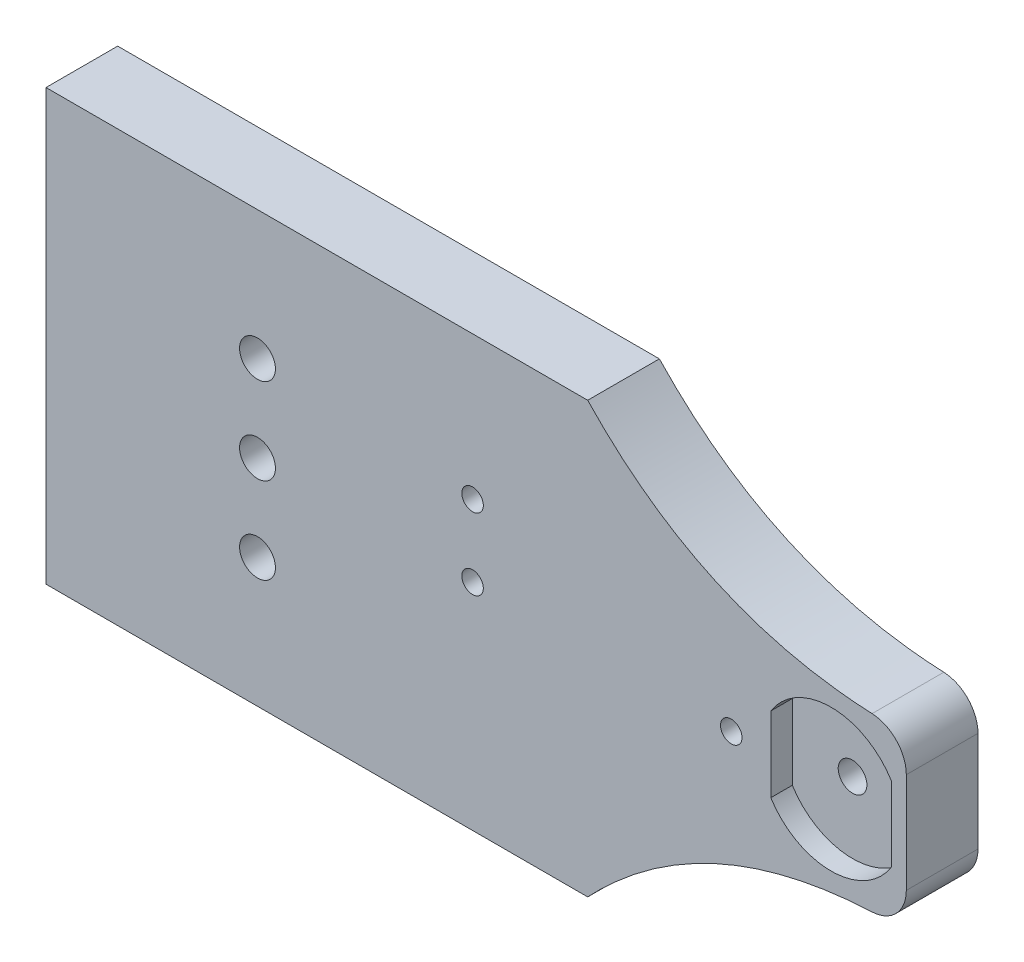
ISO-10303-21;
HEADER;
FILE_DESCRIPTION(('STEP AP214'),'2;1');
FILE_NAME('part.step','',(''),(''),'','','');
FILE_SCHEMA(('AUTOMOTIVE_DESIGN { 1 0 10303 214 1 1 1 1 }'));
ENDSEC;
DATA;
#1=APPLICATION_CONTEXT('core data for automotive mechanical design processes');
#2=APPLICATION_PROTOCOL_DEFINITION('international standard','automotive_design',2000,#1);
#3=PRODUCT_CONTEXT('',#1,'mechanical');
#4=PRODUCT('Part','Part','',(#3));
#5=PRODUCT_RELATED_PRODUCT_CATEGORY('part','',(#4));
#6=PRODUCT_DEFINITION_FORMATION('','',#4);
#7=PRODUCT_DEFINITION_CONTEXT('part definition',#1,'design');
#8=PRODUCT_DEFINITION('design','',#6,#7);
#9=PRODUCT_DEFINITION_SHAPE('','',#8);
#10=(LENGTH_UNIT() NAMED_UNIT(*) SI_UNIT(.MILLI.,.METRE.));
#11=(NAMED_UNIT(*) PLANE_ANGLE_UNIT() SI_UNIT($,.RADIAN.));
#12=(NAMED_UNIT(*) SI_UNIT($,.STERADIAN.) SOLID_ANGLE_UNIT());
#13=UNCERTAINTY_MEASURE_WITH_UNIT(LENGTH_MEASURE(1.E-05),#10,'distance_accuracy_value','');
#14=(GEOMETRIC_REPRESENTATION_CONTEXT(3) GLOBAL_UNCERTAINTY_ASSIGNED_CONTEXT((#13)) GLOBAL_UNIT_ASSIGNED_CONTEXT((#10,
#11,#12)) REPRESENTATION_CONTEXT('',''));
#15=CARTESIAN_POINT('',(0.,0.,0.));
#16=DIRECTION('',(0.,0.,1.));
#17=DIRECTION('',(1.,0.,0.));
#18=AXIS2_PLACEMENT_3D('',#15,#16,#17);
#19=CARTESIAN_POINT('',(13.9184000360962,1.95325542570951,7.));
#20=DIRECTION('',(0.,0.,1.));
#21=DIRECTION('',(1.,0.,0.));
#22=AXIS2_PLACEMENT_3D('',#19,#20,#21);
#23=CYLINDRICAL_SURFACE('',#22,9.9);
#24=CARTESIAN_POINT('',(13.9184000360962,1.95325542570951,10.));
#25=DIRECTION('',(0.,0.,1.));
#26=DIRECTION('',(1.,0.,0.));
#27=AXIS2_PLACEMENT_3D('',#24,#25,#26);
#28=CIRCLE('',#27,9.9);
#29=CARTESIAN_POINT('',(5.5184000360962,-3.28601933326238,10.));
#30=VERTEX_POINT('',#29);
#31=CARTESIAN_POINT('',(22.3184000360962,-3.28601933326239,10.));
#32=VERTEX_POINT('',#31);
#33=EDGE_CURVE('E316',#30,#32,#28,.T.);
#34=ORIENTED_EDGE('',*,*,#33,.T.);
#35=DIRECTION('',(0.,0.,1.));
#36=VECTOR('',#35,1.);
#37=CARTESIAN_POINT('',(22.3184000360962,-3.28601933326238,7.));
#38=LINE('',#37,#36);
#39=CARTESIAN_POINT('',(22.3184000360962,-3.28601933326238,7.));
#40=VERTEX_POINT('',#39);
#41=EDGE_CURVE('E319',#32,#40,#38,.F.);
#42=ORIENTED_EDGE('',*,*,#41,.T.);
#43=CARTESIAN_POINT('',(13.9184000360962,1.95325542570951,7.));
#44=DIRECTION('',(0.,0.,1.));
#45=DIRECTION('',(1.,0.,0.));
#46=AXIS2_PLACEMENT_3D('',#43,#44,#45);
#47=CIRCLE('',#46,9.9);
#48=CARTESIAN_POINT('',(5.5184000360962,-3.28601933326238,7.));
#49=VERTEX_POINT('',#48);
#50=EDGE_CURVE('E358',#49,#40,#47,.T.);
#51=ORIENTED_EDGE('',*,*,#50,.F.);
#52=DIRECTION('',(0.,0.,1.));
#53=VECTOR('',#52,1.);
#54=CARTESIAN_POINT('',(5.5184000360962,-3.28601933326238,7.));
#55=LINE('',#54,#53);
#56=EDGE_CURVE('E321',#49,#30,#55,.T.);
#57=ORIENTED_EDGE('',*,*,#56,.T.);
#58=EDGE_LOOP('',(#34,#42,#51,#57));
#59=FACE_BOUND('',#58,.T.);
#60=ADVANCED_FACE('F39',(#59),#23,.F.);
#61=CARTESIAN_POINT('',(-95.5815999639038,31.9532554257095,10.));
#62=DIRECTION('',(1.,0.,0.));
#63=DIRECTION('',(0.,1.,0.));
#64=AXIS2_PLACEMENT_3D('',#61,#62,#63);
#65=PLANE('',#64);
#66=DIRECTION('',(0.,-1.,0.));
#67=VECTOR('',#66,1.);
#68=CARTESIAN_POINT('',(-95.5815999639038,31.9532554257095,0.));
#69=LINE('',#68,#67);
#70=CARTESIAN_POINT('',(-95.5815999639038,31.9532554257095,0.));
#71=VERTEX_POINT('',#70);
#72=CARTESIAN_POINT('',(-95.5815999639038,-28.0467445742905,0.));
#73=VERTEX_POINT('',#72);
#74=EDGE_CURVE('E148',#71,#73,#69,.T.);
#75=ORIENTED_EDGE('',*,*,#74,.T.);
#76=DIRECTION('',(0.,0.,-1.));
#77=VECTOR('',#76,1.);
#78=CARTESIAN_POINT('',(-95.5815999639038,-28.0467445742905,10.));
#79=LINE('',#78,#77);
#80=CARTESIAN_POINT('',(-95.5815999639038,-28.0467445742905,10.));
#81=VERTEX_POINT('',#80);
#82=EDGE_CURVE('E162',#81,#73,#79,.T.);
#83=ORIENTED_EDGE('',*,*,#82,.F.);
#84=DIRECTION('',(0.,-1.,0.));
#85=VECTOR('',#84,1.);
#86=CARTESIAN_POINT('',(-95.5815999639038,31.9532554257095,10.));
#87=LINE('',#86,#85);
#88=CARTESIAN_POINT('',(-95.5815999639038,31.9532554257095,10.));
#89=VERTEX_POINT('',#88);
#90=EDGE_CURVE('E149',#89,#81,#87,.T.);
#91=ORIENTED_EDGE('',*,*,#90,.F.);
#92=DIRECTION('',(0.,0.,-1.));
#93=VECTOR('',#92,1.);
#94=CARTESIAN_POINT('',(-95.5815999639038,31.9532554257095,10.));
#95=LINE('',#94,#93);
#96=EDGE_CURVE('E160',#89,#71,#95,.T.);
#97=ORIENTED_EDGE('',*,*,#96,.T.);
#98=EDGE_LOOP('',(#75,#83,#91,#97));
#99=FACE_BOUND('',#98,.T.);
#100=ADVANCED_FACE('F299',(#99),#65,.F.);
#101=CARTESIAN_POINT('',(-95.5815999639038,-28.0467445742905,10.));
#102=DIRECTION('',(0.,1.,0.));
#103=DIRECTION('',(0.,0.,1.));
#104=AXIS2_PLACEMENT_3D('',#101,#102,#103);
#105=PLANE('',#104);
#106=DIRECTION('',(1.,0.,0.));
#107=VECTOR('',#106,1.);
#108=CARTESIAN_POINT('',(-95.5815999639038,-28.0467445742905,0.));
#109=LINE('',#108,#107);
#110=CARTESIAN_POINT('',(-20.02308866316,-28.0467445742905,0.));
#111=VERTEX_POINT('',#110);
#112=EDGE_CURVE('E156',#73,#111,#109,.T.);
#113=ORIENTED_EDGE('',*,*,#112,.T.);
#114=DIRECTION('',(0.,0.,1.));
#115=VECTOR('',#114,1.);
#116=CARTESIAN_POINT('',(-20.02308866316,-28.0467445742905,0.));
#117=LINE('',#116,#115);
#118=CARTESIAN_POINT('',(-20.02308866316,-28.0467445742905,10.));
#119=VERTEX_POINT('',#118);
#120=EDGE_CURVE('E214',#111,#119,#117,.T.);
#121=ORIENTED_EDGE('',*,*,#120,.T.);
#122=DIRECTION('',(1.,0.,0.));
#123=VECTOR('',#122,1.);
#124=CARTESIAN_POINT('',(-95.5815999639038,-28.0467445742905,10.));
#125=LINE('',#124,#123);
#126=EDGE_CURVE('E153',#81,#119,#125,.T.);
#127=ORIENTED_EDGE('',*,*,#126,.F.);
#128=ORIENTED_EDGE('',*,*,#82,.T.);
#129=EDGE_LOOP('',(#113,#121,#127,#128));
#130=FACE_BOUND('',#129,.T.);
#131=ADVANCED_FACE('F296',(#130),#105,.F.);
#132=CARTESIAN_POINT('',(24.4184000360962,31.9532554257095,10.));
#133=DIRECTION('',(-1.,0.,0.));
#134=DIRECTION('',(0.,-1.,0.));
#135=AXIS2_PLACEMENT_3D('',#132,#133,#134);
#136=PLANE('',#135);
#137=DIRECTION('',(0.,1.,0.));
#138=VECTOR('',#137,1.);
#139=CARTESIAN_POINT('',(24.4184000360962,31.9532554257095,0.));
#140=LINE('',#139,#138);
#141=CARTESIAN_POINT('',(24.4184000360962,-5.0320896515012,0.));
#142=VERTEX_POINT('',#141);
#143=CARTESIAN_POINT('',(24.4184000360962,8.93860050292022,0.));
#144=VERTEX_POINT('',#143);
#145=EDGE_CURVE('E150',#142,#144,#140,.T.);
#146=ORIENTED_EDGE('',*,*,#145,.T.);
#147=DIRECTION('',(0.,0.,1.));
#148=VECTOR('',#147,1.);
#149=CARTESIAN_POINT('',(24.4184000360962,8.93860050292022,10.));
#150=LINE('',#149,#148);
#151=CARTESIAN_POINT('',(24.4184000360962,8.93860050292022,10.));
#152=VERTEX_POINT('',#151);
#153=EDGE_CURVE('E194',#144,#152,#150,.T.);
#154=ORIENTED_EDGE('',*,*,#153,.T.);
#155=DIRECTION('',(0.,1.,0.));
#156=VECTOR('',#155,1.);
#157=CARTESIAN_POINT('',(24.4184000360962,31.9532554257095,10.));
#158=LINE('',#157,#156);
#159=CARTESIAN_POINT('',(24.4184000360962,-5.0320896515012,10.));
#160=VERTEX_POINT('',#159);
#161=EDGE_CURVE('E213',#160,#152,#158,.T.);
#162=ORIENTED_EDGE('',*,*,#161,.F.);
#163=DIRECTION('',(0.,0.,1.));
#164=VECTOR('',#163,1.);
#165=CARTESIAN_POINT('',(24.4184000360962,-5.0320896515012,10.));
#166=LINE('',#165,#164);
#167=EDGE_CURVE('E192',#160,#142,#166,.F.);
#168=ORIENTED_EDGE('',*,*,#167,.T.);
#169=EDGE_LOOP('',(#146,#154,#162,#168));
#170=FACE_BOUND('',#169,.T.);
#171=ADVANCED_FACE('F205',(#170),#136,.F.);
#172=CARTESIAN_POINT('',(-95.5815999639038,31.9532554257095,10.));
#173=DIRECTION('',(0.,-1.,0.));
#174=DIRECTION('',(0.,0.,-1.));
#175=AXIS2_PLACEMENT_3D('',#172,#173,#174);
#176=PLANE('',#175);
#177=DIRECTION('',(-1.,0.,0.));
#178=VECTOR('',#177,1.);
#179=CARTESIAN_POINT('',(-95.5815999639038,31.9532554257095,10.));
#180=LINE('',#179,#178);
#181=CARTESIAN_POINT('',(-20.02308866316,31.9532554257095,10.));
#182=VERTEX_POINT('',#181);
#183=EDGE_CURVE('E142',#182,#89,#180,.T.);
#184=ORIENTED_EDGE('',*,*,#183,.F.);
#185=DIRECTION('',(0.,0.,1.));
#186=VECTOR('',#185,1.);
#187=CARTESIAN_POINT('',(-20.02308866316,31.9532554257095,0.));
#188=LINE('',#187,#186);
#189=CARTESIAN_POINT('',(-20.02308866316,31.9532554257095,0.));
#190=VERTEX_POINT('',#189);
#191=EDGE_CURVE('E130',#190,#182,#188,.T.);
#192=ORIENTED_EDGE('',*,*,#191,.F.);
#193=DIRECTION('',(-1.,0.,0.));
#194=VECTOR('',#193,1.);
#195=CARTESIAN_POINT('',(-95.5815999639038,31.9532554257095,0.));
#196=LINE('',#195,#194);
#197=EDGE_CURVE('E140',#190,#71,#196,.T.);
#198=ORIENTED_EDGE('',*,*,#197,.T.);
#199=ORIENTED_EDGE('',*,*,#96,.F.);
#200=EDGE_LOOP('',(#184,#192,#198,#199));
#201=FACE_BOUND('',#200,.T.);
#202=ADVANCED_FACE('F138',(#201),#176,.F.);
#203=CARTESIAN_POINT('',(0.,0.,10.));
#204=DIRECTION('',(0.,0.,1.));
#205=DIRECTION('',(1.,0.,0.));
#206=AXIS2_PLACEMENT_3D('',#203,#204,#205);
#207=PLANE('',#206);
#208=CARTESIAN_POINT('',(0.,1.95325542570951,10.));
#209=DIRECTION('',(0.,0.,1.));
#210=DIRECTION('',(1.,0.,0.));
#211=AXIS2_PLACEMENT_3D('',#208,#209,#210);
#212=CIRCLE('',#211,1.5);
#213=CARTESIAN_POINT('',(1.49999999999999,1.95325542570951,10.));
#214=VERTEX_POINT('',#213);
#215=EDGE_CURVE('E371',#214,#214,#212,.T.);
#216=ORIENTED_EDGE('',*,*,#215,.F.);
#217=EDGE_LOOP('',(#216));
#218=FACE_BOUND('',#217,.T.);
#219=ORIENTED_EDGE('',*,*,#161,.T.);
#220=CARTESIAN_POINT('',(19.4184000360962,8.93860050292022,10.));
#221=DIRECTION('',(0.,0.,1.));
#222=DIRECTION('',(1.,0.,0.));
#223=AXIS2_PLACEMENT_3D('',#220,#221,#222);
#224=CIRCLE('',#223,5.);
#225=CARTESIAN_POINT('',(19.6444140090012,13.9334896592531,10.));
#226=VERTEX_POINT('',#225);
#227=EDGE_CURVE('E199',#152,#226,#224,.T.);
#228=ORIENTED_EDGE('',*,*,#227,.T.);
#229=CARTESIAN_POINT('',(-20.02308866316,31.9532554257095,10.));
#230=CARTESIAN_POINT('',(-2.44543676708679,13.3232157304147,10.));
#231=CARTESIAN_POINT('',(24.4184000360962,13.8771964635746,10.));
#232=B_SPLINE_CURVE_WITH_KNOTS('',2,(#229,#230,#231),.UNSPECIFIED.,.F.,.F.,(3,3),(0.,1.),.UNSPECIFIED.);
#233=EDGE_CURVE('E134',#182,#226,#232,.T.);
#234=ORIENTED_EDGE('',*,*,#233,.F.);
#235=ORIENTED_EDGE('',*,*,#183,.T.);
#236=ORIENTED_EDGE('',*,*,#90,.T.);
#237=ORIENTED_EDGE('',*,*,#126,.T.);
#238=CARTESIAN_POINT('',(24.4184000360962,-9.97068561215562,10.));
#239=CARTESIAN_POINT('',(-2.4454367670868,-9.41670487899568,10.));
#240=CARTESIAN_POINT('',(-20.02308866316,-28.0467445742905,10.));
#241=B_SPLINE_CURVE_WITH_KNOTS('',2,(#238,#239,#240),.UNSPECIFIED.,.F.,.F.,(3,3),(0.,1.),.UNSPECIFIED.);
#242=CARTESIAN_POINT('',(19.6444140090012,-10.0269788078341,10.));
#243=VERTEX_POINT('',#242);
#244=EDGE_CURVE('E233',#243,#119,#241,.T.);
#245=ORIENTED_EDGE('',*,*,#244,.F.);
#246=CARTESIAN_POINT('',(19.4184000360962,-5.0320896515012,10.));
#247=DIRECTION('',(0.,0.,1.));
#248=DIRECTION('',(1.,0.,0.));
#249=AXIS2_PLACEMENT_3D('',#246,#247,#248);
#250=CIRCLE('',#249,5.);
#251=EDGE_CURVE('E197',#243,#160,#250,.T.);
#252=ORIENTED_EDGE('',*,*,#251,.T.);
#253=EDGE_LOOP('',(#219,#228,#234,#235,#236,#237,#245,#252));
#254=FACE_BOUND('',#253,.T.);
#255=CARTESIAN_POINT('',(22.3184000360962,7.19253018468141,10.));
#256=VERTEX_POINT('',#255);
#257=CARTESIAN_POINT('',(5.5184000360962,7.1925301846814,10.));
#258=VERTEX_POINT('',#257);
#259=EDGE_CURVE('E186',#256,#258,#28,.T.);
#260=ORIENTED_EDGE('',*,*,#259,.F.);
#261=DIRECTION('',(0.,-1.,0.));
#262=VECTOR('',#261,1.);
#263=CARTESIAN_POINT('',(22.3184000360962,-8.86898109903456,10.));
#264=LINE('',#263,#262);
#265=EDGE_CURVE('E143',#256,#32,#264,.T.);
#266=ORIENTED_EDGE('',*,*,#265,.T.);
#267=ORIENTED_EDGE('',*,*,#33,.F.);
#268=DIRECTION('',(0.,1.,0.));
#269=VECTOR('',#268,1.);
#270=CARTESIAN_POINT('',(5.5184000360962,20.9569278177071,10.));
#271=LINE('',#270,#269);
#272=EDGE_CURVE('E329',#30,#258,#271,.T.);
#273=ORIENTED_EDGE('',*,*,#272,.T.);
#274=EDGE_LOOP('',(#260,#266,#267,#273));
#275=FACE_BOUND('',#274,.T.);
#276=CARTESIAN_POINT('',(-36.0815999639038,11.9532554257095,10.));
#277=DIRECTION('',(0.,0.,1.));
#278=DIRECTION('',(1.,0.,0.));
#279=AXIS2_PLACEMENT_3D('',#276,#277,#278);
#280=CIRCLE('',#279,1.5);
#281=CARTESIAN_POINT('',(-34.5815999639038,11.9532554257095,10.));
#282=VERTEX_POINT('',#281);
#283=EDGE_CURVE('E342',#282,#282,#280,.T.);
#284=ORIENTED_EDGE('',*,*,#283,.F.);
#285=EDGE_LOOP('',(#284));
#286=FACE_BOUND('',#285,.T.);
#287=CARTESIAN_POINT('',(-36.0815999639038,1.95325542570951,10.));
#288=DIRECTION('',(0.,0.,1.));
#289=DIRECTION('',(1.,0.,0.));
#290=AXIS2_PLACEMENT_3D('',#287,#288,#289);
#291=CIRCLE('',#290,1.5);
#292=CARTESIAN_POINT('',(-34.5815999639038,1.95325542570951,10.));
#293=VERTEX_POINT('',#292);
#294=EDGE_CURVE('E170',#293,#293,#291,.T.);
#295=ORIENTED_EDGE('',*,*,#294,.F.);
#296=EDGE_LOOP('',(#295));
#297=FACE_BOUND('',#296,.T.);
#298=CARTESIAN_POINT('',(-66.0815999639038,1.95325542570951,10.));
#299=DIRECTION('',(0.,0.,1.));
#300=DIRECTION('',(1.,0.,0.));
#301=AXIS2_PLACEMENT_3D('',#298,#299,#300);
#302=CIRCLE('',#301,2.5);
#303=CARTESIAN_POINT('',(-63.5815999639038,1.95325542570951,10.));
#304=VERTEX_POINT('',#303);
#305=EDGE_CURVE('E349',#304,#304,#302,.T.);
#306=ORIENTED_EDGE('',*,*,#305,.F.);
#307=EDGE_LOOP('',(#306));
#308=FACE_BOUND('',#307,.T.);
#309=CARTESIAN_POINT('',(-66.0815999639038,13.9532554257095,10.));
#310=DIRECTION('',(0.,0.,1.));
#311=DIRECTION('',(1.,0.,0.));
#312=AXIS2_PLACEMENT_3D('',#309,#310,#311);
#313=CIRCLE('',#312,2.5);
#314=CARTESIAN_POINT('',(-63.5815999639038,13.9532554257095,10.));
#315=VERTEX_POINT('',#314);
#316=EDGE_CURVE('E346',#315,#315,#313,.T.);
#317=ORIENTED_EDGE('',*,*,#316,.F.);
#318=EDGE_LOOP('',(#317));
#319=FACE_BOUND('',#318,.T.);
#320=CARTESIAN_POINT('',(-66.0815999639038,-10.0467445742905,10.));
#321=DIRECTION('',(0.,0.,1.));
#322=DIRECTION('',(1.,0.,0.));
#323=AXIS2_PLACEMENT_3D('',#320,#321,#322);
#324=CIRCLE('',#323,2.50000000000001);
#325=CARTESIAN_POINT('',(-63.5815999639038,-10.0467445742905,10.));
#326=VERTEX_POINT('',#325);
#327=EDGE_CURVE('E345',#326,#326,#324,.T.);
#328=ORIENTED_EDGE('',*,*,#327,.F.);
#329=EDGE_LOOP('',(#328));
#330=FACE_BOUND('',#329,.T.);
#331=ADVANCED_FACE('F211',(#218,#254,#275,#286,#297,#308,#319,#330),#207,.T.);
#332=CARTESIAN_POINT('',(0.,0.,0.));
#333=DIRECTION('',(0.,0.,1.));
#334=DIRECTION('',(1.,0.,0.));
#335=AXIS2_PLACEMENT_3D('',#332,#333,#334);
#336=PLANE('',#335);
#337=CARTESIAN_POINT('',(0.,1.95325542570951,0.));
#338=DIRECTION('',(0.,0.,1.));
#339=DIRECTION('',(1.,0.,0.));
#340=AXIS2_PLACEMENT_3D('',#337,#338,#339);
#341=CIRCLE('',#340,1.5);
#342=CARTESIAN_POINT('',(1.49999999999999,1.95325542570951,0.));
#343=VERTEX_POINT('',#342);
#344=EDGE_CURVE('E369',#343,#343,#341,.T.);
#345=ORIENTED_EDGE('',*,*,#344,.T.);
#346=EDGE_LOOP('',(#345));
#347=FACE_BOUND('',#346,.T.);
#348=CARTESIAN_POINT('',(13.9184000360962,1.95325542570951,0.));
#349=DIRECTION('',(0.,0.,1.));
#350=DIRECTION('',(1.,0.,0.));
#351=AXIS2_PLACEMENT_3D('',#348,#349,#350);
#352=CIRCLE('',#351,2.);
#353=CARTESIAN_POINT('',(15.9184000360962,1.95325542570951,0.));
#354=VERTEX_POINT('',#353);
#355=EDGE_CURVE('E169',#354,#354,#352,.T.);
#356=ORIENTED_EDGE('',*,*,#355,.T.);
#357=EDGE_LOOP('',(#356));
#358=FACE_BOUND('',#357,.T.);
#359=CARTESIAN_POINT('',(-36.0815999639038,11.9532554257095,0.));
#360=DIRECTION('',(0.,0.,1.));
#361=DIRECTION('',(1.,0.,0.));
#362=AXIS2_PLACEMENT_3D('',#359,#360,#361);
#363=CIRCLE('',#362,1.5);
#364=CARTESIAN_POINT('',(-34.5815999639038,11.9532554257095,0.));
#365=VERTEX_POINT('',#364);
#366=EDGE_CURVE('E183',#365,#365,#363,.T.);
#367=ORIENTED_EDGE('',*,*,#366,.T.);
#368=EDGE_LOOP('',(#367));
#369=FACE_BOUND('',#368,.T.);
#370=CARTESIAN_POINT('',(-36.0815999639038,1.95325542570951,0.));
#371=DIRECTION('',(0.,0.,1.));
#372=DIRECTION('',(1.,0.,0.));
#373=AXIS2_PLACEMENT_3D('',#370,#371,#372);
#374=CIRCLE('',#373,1.5);
#375=CARTESIAN_POINT('',(-34.5815999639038,1.95325542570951,0.));
#376=VERTEX_POINT('',#375);
#377=EDGE_CURVE('E180',#376,#376,#374,.T.);
#378=ORIENTED_EDGE('',*,*,#377,.T.);
#379=EDGE_LOOP('',(#378));
#380=FACE_BOUND('',#379,.T.);
#381=CARTESIAN_POINT('',(-66.0815999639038,1.95325542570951,0.));
#382=DIRECTION('',(0.,0.,1.));
#383=DIRECTION('',(1.,0.,0.));
#384=AXIS2_PLACEMENT_3D('',#381,#382,#383);
#385=CIRCLE('',#384,2.5);
#386=CARTESIAN_POINT('',(-63.5815999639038,1.95325542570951,0.));
#387=VERTEX_POINT('',#386);
#388=EDGE_CURVE('E177',#387,#387,#385,.T.);
#389=ORIENTED_EDGE('',*,*,#388,.T.);
#390=EDGE_LOOP('',(#389));
#391=FACE_BOUND('',#390,.T.);
#392=CARTESIAN_POINT('',(-66.0815999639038,13.9532554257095,0.));
#393=DIRECTION('',(0.,0.,1.));
#394=DIRECTION('',(1.,0.,0.));
#395=AXIS2_PLACEMENT_3D('',#392,#393,#394);
#396=CIRCLE('',#395,2.5);
#397=CARTESIAN_POINT('',(-63.5815999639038,13.9532554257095,0.));
#398=VERTEX_POINT('',#397);
#399=EDGE_CURVE('E174',#398,#398,#396,.T.);
#400=ORIENTED_EDGE('',*,*,#399,.T.);
#401=EDGE_LOOP('',(#400));
#402=FACE_BOUND('',#401,.T.);
#403=CARTESIAN_POINT('',(-66.0815999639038,-10.0467445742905,0.));
#404=DIRECTION('',(0.,0.,1.));
#405=DIRECTION('',(1.,0.,0.));
#406=AXIS2_PLACEMENT_3D('',#403,#404,#405);
#407=CIRCLE('',#406,2.50000000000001);
#408=CARTESIAN_POINT('',(-63.5815999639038,-10.0467445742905,0.));
#409=VERTEX_POINT('',#408);
#410=EDGE_CURVE('E171',#409,#409,#407,.T.);
#411=ORIENTED_EDGE('',*,*,#410,.T.);
#412=EDGE_LOOP('',(#411));
#413=FACE_BOUND('',#412,.T.);
#414=CARTESIAN_POINT('',(-20.02308866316,31.9532554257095,0.));
#415=CARTESIAN_POINT('',(-2.44543676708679,13.3232157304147,0.));
#416=CARTESIAN_POINT('',(24.4184000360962,13.8771964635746,0.));
#417=B_SPLINE_CURVE_WITH_KNOTS('',2,(#414,#415,#416),.UNSPECIFIED.,.F.,.F.,(3,3),(0.,1.),.UNSPECIFIED.);
#418=CARTESIAN_POINT('',(19.6444140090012,13.9334896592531,0.));
#419=VERTEX_POINT('',#418);
#420=EDGE_CURVE('E127',#190,#419,#417,.T.);
#421=ORIENTED_EDGE('',*,*,#420,.T.);
#422=CARTESIAN_POINT('',(19.4184000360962,8.93860050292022,0.));
#423=DIRECTION('',(0.,0.,1.));
#424=DIRECTION('',(1.,0.,0.));
#425=AXIS2_PLACEMENT_3D('',#422,#423,#424);
#426=CIRCLE('',#425,5.);
#427=EDGE_CURVE('E47',#419,#144,#426,.F.);
#428=ORIENTED_EDGE('',*,*,#427,.T.);
#429=ORIENTED_EDGE('',*,*,#145,.F.);
#430=CARTESIAN_POINT('',(19.4184000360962,-5.0320896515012,0.));
#431=DIRECTION('',(0.,0.,1.));
#432=DIRECTION('',(1.,0.,0.));
#433=AXIS2_PLACEMENT_3D('',#430,#431,#432);
#434=CIRCLE('',#433,5.);
#435=CARTESIAN_POINT('',(19.6444140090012,-10.0269788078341,0.));
#436=VERTEX_POINT('',#435);
#437=EDGE_CURVE('E54',#142,#436,#434,.F.);
#438=ORIENTED_EDGE('',*,*,#437,.T.);
#439=CARTESIAN_POINT('',(24.4184000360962,-9.97068561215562,0.));
#440=CARTESIAN_POINT('',(-2.4454367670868,-9.41670487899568,0.));
#441=CARTESIAN_POINT('',(-20.02308866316,-28.0467445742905,0.));
#442=B_SPLINE_CURVE_WITH_KNOTS('',2,(#439,#440,#441),.UNSPECIFIED.,.F.,.F.,(3,3),(0.,1.),.UNSPECIFIED.);
#443=EDGE_CURVE('E217',#436,#111,#442,.T.);
#444=ORIENTED_EDGE('',*,*,#443,.T.);
#445=ORIENTED_EDGE('',*,*,#112,.F.);
#446=ORIENTED_EDGE('',*,*,#74,.F.);
#447=ORIENTED_EDGE('',*,*,#197,.F.);
#448=EDGE_LOOP('',(#421,#428,#429,#438,#444,#445,#446,#447));
#449=FACE_BOUND('',#448,.T.);
#450=ADVANCED_FACE('F146',(#347,#358,#369,#380,#391,#402,#413,#449),#336,.F.);
#451=CARTESIAN_POINT('',(22.3184000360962,7.19253018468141,7.));
#452=VERTEX_POINT('',#451);
#453=CARTESIAN_POINT('',(5.5184000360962,7.1925301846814,7.));
#454=VERTEX_POINT('',#453);
#455=EDGE_CURVE('E325',#452,#454,#47,.T.);
#456=ORIENTED_EDGE('',*,*,#455,.F.);
#457=DIRECTION('',(0.,0.,1.));
#458=VECTOR('',#457,1.);
#459=CARTESIAN_POINT('',(22.3184000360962,7.19253018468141,7.));
#460=LINE('',#459,#458);
#461=EDGE_CURVE('E330',#452,#256,#460,.T.);
#462=ORIENTED_EDGE('',*,*,#461,.T.);
#463=ORIENTED_EDGE('',*,*,#259,.T.);
#464=DIRECTION('',(0.,0.,1.));
#465=VECTOR('',#464,1.);
#466=CARTESIAN_POINT('',(5.5184000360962,7.1925301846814,7.));
#467=LINE('',#466,#465);
#468=EDGE_CURVE('E339',#258,#454,#467,.F.);
#469=ORIENTED_EDGE('',*,*,#468,.T.);
#470=EDGE_LOOP('',(#456,#462,#463,#469));
#471=FACE_BOUND('',#470,.T.);
#472=ADVANCED_FACE('F281',(#471),#23,.F.);
#473=CARTESIAN_POINT('',(13.9184000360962,1.95325542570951,7.));
#474=DIRECTION('',(0.,0.,1.));
#475=DIRECTION('',(1.,0.,0.));
#476=AXIS2_PLACEMENT_3D('',#473,#474,#475);
#477=PLANE('',#476);
#478=DIRECTION('',(0.,-1.,0.));
#479=VECTOR('',#478,1.);
#480=CARTESIAN_POINT('',(22.3184000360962,1.95325542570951,7.));
#481=LINE('',#480,#479);
#482=EDGE_CURVE('E189',#452,#40,#481,.T.);
#483=ORIENTED_EDGE('',*,*,#482,.F.);
#484=ORIENTED_EDGE('',*,*,#455,.T.);
#485=DIRECTION('',(0.,1.,0.));
#486=VECTOR('',#485,1.);
#487=CARTESIAN_POINT('',(5.5184000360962,1.95325542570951,7.));
#488=LINE('',#487,#486);
#489=EDGE_CURVE('E165',#49,#454,#488,.T.);
#490=ORIENTED_EDGE('',*,*,#489,.F.);
#491=ORIENTED_EDGE('',*,*,#50,.T.);
#492=EDGE_LOOP('',(#483,#484,#490,#491));
#493=FACE_BOUND('',#492,.T.);
#494=CARTESIAN_POINT('',(13.9184000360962,1.95325542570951,7.));
#495=DIRECTION('',(0.,0.,1.));
#496=DIRECTION('',(1.,0.,0.));
#497=AXIS2_PLACEMENT_3D('',#494,#495,#496);
#498=CIRCLE('',#497,2.);
#499=CARTESIAN_POINT('',(15.9184000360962,1.95325542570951,7.));
#500=VERTEX_POINT('',#499);
#501=EDGE_CURVE('E166',#500,#500,#498,.T.);
#502=ORIENTED_EDGE('',*,*,#501,.F.);
#503=EDGE_LOOP('',(#502));
#504=FACE_BOUND('',#503,.T.);
#505=ADVANCED_FACE('F259',(#493,#504),#477,.T.);
#506=CARTESIAN_POINT('',(13.9184000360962,1.95325542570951,-1.2E-05));
#507=DIRECTION('',(0.,0.,1.));
#508=DIRECTION('',(1.,0.,0.));
#509=AXIS2_PLACEMENT_3D('',#506,#507,#508);
#510=CYLINDRICAL_SURFACE('',#509,2.);
#511=CARTESIAN_POINT('',(15.9184000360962,1.95325542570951,7.));
#512=CARTESIAN_POINT('',(15.9184000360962,1.95325542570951,6.92708333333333));
#513=CARTESIAN_POINT('',(15.9184000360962,1.95325542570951,6.85416666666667));
#514=CARTESIAN_POINT('',(15.9184000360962,1.95325542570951,6.70833333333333));
#515=CARTESIAN_POINT('',(15.9184000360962,1.95325542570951,6.63541666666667));
#516=CARTESIAN_POINT('',(15.9184000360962,1.95325542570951,6.48958333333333));
#517=CARTESIAN_POINT('',(15.9184000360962,1.95325542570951,6.41666666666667));
#518=CARTESIAN_POINT('',(15.9184000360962,1.95325542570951,6.27083333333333));
#519=CARTESIAN_POINT('',(15.9184000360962,1.95325542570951,6.19791666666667));
#520=CARTESIAN_POINT('',(15.9184000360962,1.95325542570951,6.05208333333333));
#521=CARTESIAN_POINT('',(15.9184000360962,1.95325542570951,5.97916666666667));
#522=CARTESIAN_POINT('',(15.9184000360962,1.95325542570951,5.83333333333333));
#523=CARTESIAN_POINT('',(15.9184000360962,1.95325542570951,5.76041666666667));
#524=CARTESIAN_POINT('',(15.9184000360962,1.95325542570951,5.61458333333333));
#525=CARTESIAN_POINT('',(15.9184000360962,1.95325542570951,5.54166666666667));
#526=CARTESIAN_POINT('',(15.9184000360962,1.95325542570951,5.39583333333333));
#527=CARTESIAN_POINT('',(15.9184000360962,1.95325542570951,5.32291666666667));
#528=CARTESIAN_POINT('',(15.9184000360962,1.95325542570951,5.17708333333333));
#529=CARTESIAN_POINT('',(15.9184000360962,1.95325542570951,5.10416666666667));
#530=CARTESIAN_POINT('',(15.9184000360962,1.95325542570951,4.95833333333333));
#531=CARTESIAN_POINT('',(15.9184000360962,1.95325542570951,4.88541666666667));
#532=CARTESIAN_POINT('',(15.9184000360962,1.95325542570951,4.73958333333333));
#533=CARTESIAN_POINT('',(15.9184000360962,1.95325542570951,4.66666666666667));
#534=CARTESIAN_POINT('',(15.9184000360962,1.95325542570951,4.52083333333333));
#535=CARTESIAN_POINT('',(15.9184000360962,1.95325542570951,4.44791666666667));
#536=CARTESIAN_POINT('',(15.9184000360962,1.95325542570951,4.30208333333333));
#537=CARTESIAN_POINT('',(15.9184000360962,1.95325542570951,4.22916666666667));
#538=CARTESIAN_POINT('',(15.9184000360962,1.95325542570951,4.08333333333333));
#539=CARTESIAN_POINT('',(15.9184000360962,1.95325542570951,4.01041666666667));
#540=CARTESIAN_POINT('',(15.9184000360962,1.95325542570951,3.86458333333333));
#541=CARTESIAN_POINT('',(15.9184000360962,1.95325542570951,3.79166666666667));
#542=CARTESIAN_POINT('',(15.9184000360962,1.95325542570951,3.64583333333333));
#543=CARTESIAN_POINT('',(15.9184000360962,1.95325542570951,3.57291666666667));
#544=CARTESIAN_POINT('',(15.9184000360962,1.95325542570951,3.42708333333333));
#545=CARTESIAN_POINT('',(15.9184000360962,1.95325542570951,3.35416666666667));
#546=CARTESIAN_POINT('',(15.9184000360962,1.95325542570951,3.20833333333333));
#547=CARTESIAN_POINT('',(15.9184000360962,1.95325542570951,3.13541666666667));
#548=CARTESIAN_POINT('',(15.9184000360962,1.95325542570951,2.98958333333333));
#549=CARTESIAN_POINT('',(15.9184000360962,1.95325542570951,2.91666666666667));
#550=CARTESIAN_POINT('',(15.9184000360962,1.95325542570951,2.77083333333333));
#551=CARTESIAN_POINT('',(15.9184000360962,1.95325542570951,2.69791666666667));
#552=CARTESIAN_POINT('',(15.9184000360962,1.95325542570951,2.55208333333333));
#553=CARTESIAN_POINT('',(15.9184000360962,1.95325542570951,2.47916666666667));
#554=CARTESIAN_POINT('',(15.9184000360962,1.95325542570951,2.33333333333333));
#555=CARTESIAN_POINT('',(15.9184000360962,1.95325542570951,2.26041666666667));
#556=CARTESIAN_POINT('',(15.9184000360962,1.95325542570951,2.11458333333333));
#557=CARTESIAN_POINT('',(15.9184000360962,1.95325542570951,2.04166666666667));
#558=CARTESIAN_POINT('',(15.9184000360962,1.95325542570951,1.89583333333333));
#559=CARTESIAN_POINT('',(15.9184000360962,1.95325542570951,1.82291666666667));
#560=CARTESIAN_POINT('',(15.9184000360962,1.95325542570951,1.67708333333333));
#561=CARTESIAN_POINT('',(15.9184000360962,1.95325542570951,1.60416666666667));
#562=CARTESIAN_POINT('',(15.9184000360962,1.95325542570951,1.45833333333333));
#563=CARTESIAN_POINT('',(15.9184000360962,1.95325542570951,1.38541666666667));
#564=CARTESIAN_POINT('',(15.9184000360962,1.95325542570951,1.23958333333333));
#565=CARTESIAN_POINT('',(15.9184000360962,1.95325542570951,1.16666666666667));
#566=CARTESIAN_POINT('',(15.9184000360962,1.95325542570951,1.02083333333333));
#567=CARTESIAN_POINT('',(15.9184000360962,1.95325542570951,0.947916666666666));
#568=CARTESIAN_POINT('',(15.9184000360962,1.95325542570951,0.802083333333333));
#569=CARTESIAN_POINT('',(15.9184000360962,1.95325542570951,0.729166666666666));
#570=CARTESIAN_POINT('',(15.9184000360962,1.95325542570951,0.583333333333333));
#571=CARTESIAN_POINT('',(15.9184000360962,1.95325542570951,0.510416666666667));
#572=CARTESIAN_POINT('',(15.9184000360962,1.95325542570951,0.364583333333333));
#573=CARTESIAN_POINT('',(15.9184000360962,1.95325542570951,0.291666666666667));
#574=CARTESIAN_POINT('',(15.9184000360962,1.95325542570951,0.145833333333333));
#575=CARTESIAN_POINT('',(15.9184000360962,1.95325542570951,0.0729166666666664));
#576=CARTESIAN_POINT('',(15.9184000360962,1.95325542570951,0.));
#577=B_SPLINE_CURVE_WITH_KNOTS('',3,(#511,#512,#513,#514,#515,#516,#517,#518,#519,#520,#521,
#522,#523,#524,#525,#526,#527,#528,#529,#530,#531,#532,#533,#534,#535,#536,#537,#538,#539,#540,
#541,#542,#543,#544,#545,#546,#547,#548,#549,#550,#551,#552,#553,#554,#555,#556,#557,#558,#559,
#560,#561,#562,#563,#564,#565,#566,#567,#568,#569,#570,#571,#572,#573,#574,#575,#576),
.UNSPECIFIED.,.F.,.F.,(4,2,2,2,2,2,2,2,2,2,2,2,2,2,2,2,2,2,2,2,2,2,2,2,2,2,2,2,2,2,2,2,4),(0.,
0.21875,0.4375,0.65625,0.875,1.09375,1.3125,1.53125,1.75,1.96875,2.1875,2.40625,2.625,2.84375,
3.0625,3.28125,3.5,3.71875,3.9375,4.15625,4.375,4.59375,4.8125,5.03125,5.25,5.46875,5.6875,
5.90625,6.125,6.34375,6.5625,6.78125,7.),.UNSPECIFIED.);
#578=EDGE_CURVE('BSEAM255',#500,#354,#577,.T.);
#579=ORIENTED_EDGE('',*,*,#501,.T.);
#580=ORIENTED_EDGE('',*,*,#355,.F.);
#581=ORIENTED_EDGE('',*,*,#578,.T.);
#582=ORIENTED_EDGE('',*,*,#578,.F.);
#583=EDGE_LOOP('',(#579,#581,#580,#582));
#584=FACE_BOUND('',#583,.T.);
#585=ADVANCED_FACE('F255',(#584),#510,.F.);
#586=CARTESIAN_POINT('',(-66.0815999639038,-10.0467445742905,-1.2E-05));
#587=DIRECTION('',(0.,0.,1.));
#588=DIRECTION('',(1.,0.,0.));
#589=AXIS2_PLACEMENT_3D('',#586,#587,#588);
#590=CYLINDRICAL_SURFACE('',#589,2.50000000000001);
#591=CARTESIAN_POINT('',(-63.5815999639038,-10.0467445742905,10.));
#592=CARTESIAN_POINT('',(-63.5815999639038,-10.0467445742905,9.89583333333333));
#593=CARTESIAN_POINT('',(-63.5815999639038,-10.0467445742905,9.79166666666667));
#594=CARTESIAN_POINT('',(-63.5815999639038,-10.0467445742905,9.58333333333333));
#595=CARTESIAN_POINT('',(-63.5815999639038,-10.0467445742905,9.47916666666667));
#596=CARTESIAN_POINT('',(-63.5815999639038,-10.0467445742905,9.27083333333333));
#597=CARTESIAN_POINT('',(-63.5815999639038,-10.0467445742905,9.16666666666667));
#598=CARTESIAN_POINT('',(-63.5815999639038,-10.0467445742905,8.95833333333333));
#599=CARTESIAN_POINT('',(-63.5815999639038,-10.0467445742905,8.85416666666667));
#600=CARTESIAN_POINT('',(-63.5815999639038,-10.0467445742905,8.64583333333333));
#601=CARTESIAN_POINT('',(-63.5815999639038,-10.0467445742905,8.54166666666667));
#602=CARTESIAN_POINT('',(-63.5815999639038,-10.0467445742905,8.33333333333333));
#603=CARTESIAN_POINT('',(-63.5815999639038,-10.0467445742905,8.22916666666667));
#604=CARTESIAN_POINT('',(-63.5815999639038,-10.0467445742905,8.02083333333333));
#605=CARTESIAN_POINT('',(-63.5815999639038,-10.0467445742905,7.91666666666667));
#606=CARTESIAN_POINT('',(-63.5815999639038,-10.0467445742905,7.70833333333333));
#607=CARTESIAN_POINT('',(-63.5815999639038,-10.0467445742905,7.60416666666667));
#608=CARTESIAN_POINT('',(-63.5815999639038,-10.0467445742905,7.39583333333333));
#609=CARTESIAN_POINT('',(-63.5815999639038,-10.0467445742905,7.29166666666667));
#610=CARTESIAN_POINT('',(-63.5815999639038,-10.0467445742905,7.08333333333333));
#611=CARTESIAN_POINT('',(-63.5815999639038,-10.0467445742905,6.97916666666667));
#612=CARTESIAN_POINT('',(-63.5815999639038,-10.0467445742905,6.77083333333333));
#613=CARTESIAN_POINT('',(-63.5815999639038,-10.0467445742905,6.66666666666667));
#614=CARTESIAN_POINT('',(-63.5815999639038,-10.0467445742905,6.45833333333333));
#615=CARTESIAN_POINT('',(-63.5815999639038,-10.0467445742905,6.35416666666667));
#616=CARTESIAN_POINT('',(-63.5815999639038,-10.0467445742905,6.14583333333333));
#617=CARTESIAN_POINT('',(-63.5815999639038,-10.0467445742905,6.04166666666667));
#618=CARTESIAN_POINT('',(-63.5815999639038,-10.0467445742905,5.83333333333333));
#619=CARTESIAN_POINT('',(-63.5815999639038,-10.0467445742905,5.72916666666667));
#620=CARTESIAN_POINT('',(-63.5815999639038,-10.0467445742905,5.52083333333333));
#621=CARTESIAN_POINT('',(-63.5815999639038,-10.0467445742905,5.41666666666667));
#622=CARTESIAN_POINT('',(-63.5815999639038,-10.0467445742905,5.20833333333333));
#623=CARTESIAN_POINT('',(-63.5815999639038,-10.0467445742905,5.10416666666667));
#624=CARTESIAN_POINT('',(-63.5815999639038,-10.0467445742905,4.89583333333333));
#625=CARTESIAN_POINT('',(-63.5815999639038,-10.0467445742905,4.79166666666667));
#626=CARTESIAN_POINT('',(-63.5815999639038,-10.0467445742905,4.58333333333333));
#627=CARTESIAN_POINT('',(-63.5815999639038,-10.0467445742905,4.47916666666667));
#628=CARTESIAN_POINT('',(-63.5815999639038,-10.0467445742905,4.27083333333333));
#629=CARTESIAN_POINT('',(-63.5815999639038,-10.0467445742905,4.16666666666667));
#630=CARTESIAN_POINT('',(-63.5815999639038,-10.0467445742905,3.95833333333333));
#631=CARTESIAN_POINT('',(-63.5815999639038,-10.0467445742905,3.85416666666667));
#632=CARTESIAN_POINT('',(-63.5815999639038,-10.0467445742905,3.64583333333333));
#633=CARTESIAN_POINT('',(-63.5815999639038,-10.0467445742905,3.54166666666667));
#634=CARTESIAN_POINT('',(-63.5815999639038,-10.0467445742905,3.33333333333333));
#635=CARTESIAN_POINT('',(-63.5815999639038,-10.0467445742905,3.22916666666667));
#636=CARTESIAN_POINT('',(-63.5815999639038,-10.0467445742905,3.02083333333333));
#637=CARTESIAN_POINT('',(-63.5815999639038,-10.0467445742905,2.91666666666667));
#638=CARTESIAN_POINT('',(-63.5815999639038,-10.0467445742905,2.70833333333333));
#639=CARTESIAN_POINT('',(-63.5815999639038,-10.0467445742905,2.60416666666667));
#640=CARTESIAN_POINT('',(-63.5815999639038,-10.0467445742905,2.39583333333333));
#641=CARTESIAN_POINT('',(-63.5815999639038,-10.0467445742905,2.29166666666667));
#642=CARTESIAN_POINT('',(-63.5815999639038,-10.0467445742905,2.08333333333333));
#643=CARTESIAN_POINT('',(-63.5815999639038,-10.0467445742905,1.97916666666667));
#644=CARTESIAN_POINT('',(-63.5815999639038,-10.0467445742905,1.77083333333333));
#645=CARTESIAN_POINT('',(-63.5815999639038,-10.0467445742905,1.66666666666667));
#646=CARTESIAN_POINT('',(-63.5815999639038,-10.0467445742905,1.45833333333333));
#647=CARTESIAN_POINT('',(-63.5815999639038,-10.0467445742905,1.35416666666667));
#648=CARTESIAN_POINT('',(-63.5815999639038,-10.0467445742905,1.14583333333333));
#649=CARTESIAN_POINT('',(-63.5815999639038,-10.0467445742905,1.04166666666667));
#650=CARTESIAN_POINT('',(-63.5815999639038,-10.0467445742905,0.833333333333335));
#651=CARTESIAN_POINT('',(-63.5815999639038,-10.0467445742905,0.729166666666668));
#652=CARTESIAN_POINT('',(-63.5815999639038,-10.0467445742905,0.520833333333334));
#653=CARTESIAN_POINT('',(-63.5815999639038,-10.0467445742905,0.416666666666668));
#654=CARTESIAN_POINT('',(-63.5815999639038,-10.0467445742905,0.208333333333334));
#655=CARTESIAN_POINT('',(-63.5815999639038,-10.0467445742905,0.104166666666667));
#656=CARTESIAN_POINT('',(-63.5815999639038,-10.0467445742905,0.));
#657=B_SPLINE_CURVE_WITH_KNOTS('',3,(#591,#592,#593,#594,#595,#596,#597,#598,#599,#600,#601,
#602,#603,#604,#605,#606,#607,#608,#609,#610,#611,#612,#613,#614,#615,#616,#617,#618,#619,#620,
#621,#622,#623,#624,#625,#626,#627,#628,#629,#630,#631,#632,#633,#634,#635,#636,#637,#638,#639,
#640,#641,#642,#643,#644,#645,#646,#647,#648,#649,#650,#651,#652,#653,#654,#655,#656),
.UNSPECIFIED.,.F.,.F.,(4,2,2,2,2,2,2,2,2,2,2,2,2,2,2,2,2,2,2,2,2,2,2,2,2,2,2,2,2,2,2,2,4),(0.,
0.3125,0.625000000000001,0.937500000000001,1.25,1.5625,1.875,2.1875,2.5,2.8125,3.125,3.4375,
3.75,4.0625,4.375,4.6875,5.,5.3125,5.625,5.9375,6.25,6.5625,6.875,7.1875,7.5,7.8125,8.125,
8.4375,8.75,9.0625,9.375,9.6875,10.),.UNSPECIFIED.);
#658=EDGE_CURVE('BSEAM258',#326,#409,#657,.T.);
#659=ORIENTED_EDGE('',*,*,#327,.T.);
#660=ORIENTED_EDGE('',*,*,#410,.F.);
#661=ORIENTED_EDGE('',*,*,#658,.T.);
#662=ORIENTED_EDGE('',*,*,#658,.F.);
#663=EDGE_LOOP('',(#659,#661,#660,#662));
#664=FACE_BOUND('',#663,.T.);
#665=ADVANCED_FACE('F258',(#664),#590,.F.);
#666=CARTESIAN_POINT('',(-66.0815999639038,13.9532554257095,-1.2E-05));
#667=DIRECTION('',(0.,0.,1.));
#668=DIRECTION('',(1.,0.,0.));
#669=AXIS2_PLACEMENT_3D('',#666,#667,#668);
#670=CYLINDRICAL_SURFACE('',#669,2.5);
#671=CARTESIAN_POINT('',(-63.5815999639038,13.9532554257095,10.));
#672=CARTESIAN_POINT('',(-63.5815999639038,13.9532554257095,9.89583333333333));
#673=CARTESIAN_POINT('',(-63.5815999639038,13.9532554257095,9.79166666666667));
#674=CARTESIAN_POINT('',(-63.5815999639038,13.9532554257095,9.58333333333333));
#675=CARTESIAN_POINT('',(-63.5815999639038,13.9532554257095,9.47916666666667));
#676=CARTESIAN_POINT('',(-63.5815999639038,13.9532554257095,9.27083333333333));
#677=CARTESIAN_POINT('',(-63.5815999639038,13.9532554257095,9.16666666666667));
#678=CARTESIAN_POINT('',(-63.5815999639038,13.9532554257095,8.95833333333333));
#679=CARTESIAN_POINT('',(-63.5815999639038,13.9532554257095,8.85416666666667));
#680=CARTESIAN_POINT('',(-63.5815999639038,13.9532554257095,8.64583333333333));
#681=CARTESIAN_POINT('',(-63.5815999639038,13.9532554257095,8.54166666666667));
#682=CARTESIAN_POINT('',(-63.5815999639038,13.9532554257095,8.33333333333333));
#683=CARTESIAN_POINT('',(-63.5815999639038,13.9532554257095,8.22916666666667));
#684=CARTESIAN_POINT('',(-63.5815999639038,13.9532554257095,8.02083333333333));
#685=CARTESIAN_POINT('',(-63.5815999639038,13.9532554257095,7.91666666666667));
#686=CARTESIAN_POINT('',(-63.5815999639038,13.9532554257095,7.70833333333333));
#687=CARTESIAN_POINT('',(-63.5815999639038,13.9532554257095,7.60416666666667));
#688=CARTESIAN_POINT('',(-63.5815999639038,13.9532554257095,7.39583333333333));
#689=CARTESIAN_POINT('',(-63.5815999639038,13.9532554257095,7.29166666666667));
#690=CARTESIAN_POINT('',(-63.5815999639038,13.9532554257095,7.08333333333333));
#691=CARTESIAN_POINT('',(-63.5815999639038,13.9532554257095,6.97916666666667));
#692=CARTESIAN_POINT('',(-63.5815999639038,13.9532554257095,6.77083333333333));
#693=CARTESIAN_POINT('',(-63.5815999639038,13.9532554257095,6.66666666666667));
#694=CARTESIAN_POINT('',(-63.5815999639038,13.9532554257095,6.45833333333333));
#695=CARTESIAN_POINT('',(-63.5815999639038,13.9532554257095,6.35416666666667));
#696=CARTESIAN_POINT('',(-63.5815999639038,13.9532554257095,6.14583333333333));
#697=CARTESIAN_POINT('',(-63.5815999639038,13.9532554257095,6.04166666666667));
#698=CARTESIAN_POINT('',(-63.5815999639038,13.9532554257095,5.83333333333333));
#699=CARTESIAN_POINT('',(-63.5815999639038,13.9532554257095,5.72916666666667));
#700=CARTESIAN_POINT('',(-63.5815999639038,13.9532554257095,5.52083333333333));
#701=CARTESIAN_POINT('',(-63.5815999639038,13.9532554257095,5.41666666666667));
#702=CARTESIAN_POINT('',(-63.5815999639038,13.9532554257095,5.20833333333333));
#703=CARTESIAN_POINT('',(-63.5815999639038,13.9532554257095,5.10416666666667));
#704=CARTESIAN_POINT('',(-63.5815999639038,13.9532554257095,4.89583333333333));
#705=CARTESIAN_POINT('',(-63.5815999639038,13.9532554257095,4.79166666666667));
#706=CARTESIAN_POINT('',(-63.5815999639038,13.9532554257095,4.58333333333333));
#707=CARTESIAN_POINT('',(-63.5815999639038,13.9532554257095,4.47916666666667));
#708=CARTESIAN_POINT('',(-63.5815999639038,13.9532554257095,4.27083333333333));
#709=CARTESIAN_POINT('',(-63.5815999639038,13.9532554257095,4.16666666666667));
#710=CARTESIAN_POINT('',(-63.5815999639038,13.9532554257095,3.95833333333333));
#711=CARTESIAN_POINT('',(-63.5815999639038,13.9532554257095,3.85416666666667));
#712=CARTESIAN_POINT('',(-63.5815999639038,13.9532554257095,3.64583333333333));
#713=CARTESIAN_POINT('',(-63.5815999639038,13.9532554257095,3.54166666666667));
#714=CARTESIAN_POINT('',(-63.5815999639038,13.9532554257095,3.33333333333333));
#715=CARTESIAN_POINT('',(-63.5815999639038,13.9532554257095,3.22916666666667));
#716=CARTESIAN_POINT('',(-63.5815999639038,13.9532554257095,3.02083333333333));
#717=CARTESIAN_POINT('',(-63.5815999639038,13.9532554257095,2.91666666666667));
#718=CARTESIAN_POINT('',(-63.5815999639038,13.9532554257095,2.70833333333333));
#719=CARTESIAN_POINT('',(-63.5815999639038,13.9532554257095,2.60416666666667));
#720=CARTESIAN_POINT('',(-63.5815999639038,13.9532554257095,2.39583333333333));
#721=CARTESIAN_POINT('',(-63.5815999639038,13.9532554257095,2.29166666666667));
#722=CARTESIAN_POINT('',(-63.5815999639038,13.9532554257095,2.08333333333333));
#723=CARTESIAN_POINT('',(-63.5815999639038,13.9532554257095,1.97916666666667));
#724=CARTESIAN_POINT('',(-63.5815999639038,13.9532554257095,1.77083333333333));
#725=CARTESIAN_POINT('',(-63.5815999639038,13.9532554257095,1.66666666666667));
#726=CARTESIAN_POINT('',(-63.5815999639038,13.9532554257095,1.45833333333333));
#727=CARTESIAN_POINT('',(-63.5815999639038,13.9532554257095,1.35416666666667));
#728=CARTESIAN_POINT('',(-63.5815999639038,13.9532554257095,1.14583333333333));
#729=CARTESIAN_POINT('',(-63.5815999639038,13.9532554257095,1.04166666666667));
#730=CARTESIAN_POINT('',(-63.5815999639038,13.9532554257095,0.833333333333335));
#731=CARTESIAN_POINT('',(-63.5815999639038,13.9532554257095,0.729166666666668));
#732=CARTESIAN_POINT('',(-63.5815999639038,13.9532554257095,0.520833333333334));
#733=CARTESIAN_POINT('',(-63.5815999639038,13.9532554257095,0.416666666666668));
#734=CARTESIAN_POINT('',(-63.5815999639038,13.9532554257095,0.208333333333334));
#735=CARTESIAN_POINT('',(-63.5815999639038,13.9532554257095,0.104166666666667));
#736=CARTESIAN_POINT('',(-63.5815999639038,13.9532554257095,0.));
#737=B_SPLINE_CURVE_WITH_KNOTS('',3,(#671,#672,#673,#674,#675,#676,#677,#678,#679,#680,#681,
#682,#683,#684,#685,#686,#687,#688,#689,#690,#691,#692,#693,#694,#695,#696,#697,#698,#699,#700,
#701,#702,#703,#704,#705,#706,#707,#708,#709,#710,#711,#712,#713,#714,#715,#716,#717,#718,#719,
#720,#721,#722,#723,#724,#725,#726,#727,#728,#729,#730,#731,#732,#733,#734,#735,#736),
.UNSPECIFIED.,.F.,.F.,(4,2,2,2,2,2,2,2,2,2,2,2,2,2,2,2,2,2,2,2,2,2,2,2,2,2,2,2,2,2,2,2,4),(0.,
0.3125,0.625000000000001,0.937500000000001,1.25,1.5625,1.875,2.1875,2.5,2.8125,3.125,3.4375,
3.75,4.0625,4.375,4.6875,5.,5.3125,5.625,5.9375,6.25,6.5625,6.875,7.1875,7.5,7.8125,8.125,
8.4375,8.75,9.0625,9.375,9.6875,10.),.UNSPECIFIED.);
#738=EDGE_CURVE('BSEAM265',#315,#398,#737,.T.);
#739=ORIENTED_EDGE('',*,*,#316,.T.);
#740=ORIENTED_EDGE('',*,*,#399,.F.);
#741=ORIENTED_EDGE('',*,*,#738,.T.);
#742=ORIENTED_EDGE('',*,*,#738,.F.);
#743=EDGE_LOOP('',(#739,#741,#740,#742));
#744=FACE_BOUND('',#743,.T.);
#745=ADVANCED_FACE('F265',(#744),#670,.F.);
#746=CARTESIAN_POINT('',(-66.0815999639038,1.95325542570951,-1.2E-05));
#747=DIRECTION('',(0.,0.,1.));
#748=DIRECTION('',(1.,0.,0.));
#749=AXIS2_PLACEMENT_3D('',#746,#747,#748);
#750=CYLINDRICAL_SURFACE('',#749,2.5);
#751=CARTESIAN_POINT('',(-63.5815999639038,1.95325542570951,10.));
#752=CARTESIAN_POINT('',(-63.5815999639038,1.95325542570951,9.89583333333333));
#753=CARTESIAN_POINT('',(-63.5815999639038,1.95325542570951,9.79166666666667));
#754=CARTESIAN_POINT('',(-63.5815999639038,1.95325542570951,9.58333333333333));
#755=CARTESIAN_POINT('',(-63.5815999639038,1.95325542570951,9.47916666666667));
#756=CARTESIAN_POINT('',(-63.5815999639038,1.95325542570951,9.27083333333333));
#757=CARTESIAN_POINT('',(-63.5815999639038,1.95325542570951,9.16666666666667));
#758=CARTESIAN_POINT('',(-63.5815999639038,1.95325542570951,8.95833333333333));
#759=CARTESIAN_POINT('',(-63.5815999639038,1.95325542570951,8.85416666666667));
#760=CARTESIAN_POINT('',(-63.5815999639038,1.95325542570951,8.64583333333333));
#761=CARTESIAN_POINT('',(-63.5815999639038,1.95325542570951,8.54166666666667));
#762=CARTESIAN_POINT('',(-63.5815999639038,1.95325542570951,8.33333333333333));
#763=CARTESIAN_POINT('',(-63.5815999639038,1.95325542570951,8.22916666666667));
#764=CARTESIAN_POINT('',(-63.5815999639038,1.95325542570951,8.02083333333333));
#765=CARTESIAN_POINT('',(-63.5815999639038,1.95325542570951,7.91666666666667));
#766=CARTESIAN_POINT('',(-63.5815999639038,1.95325542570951,7.70833333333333));
#767=CARTESIAN_POINT('',(-63.5815999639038,1.95325542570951,7.60416666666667));
#768=CARTESIAN_POINT('',(-63.5815999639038,1.95325542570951,7.39583333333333));
#769=CARTESIAN_POINT('',(-63.5815999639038,1.95325542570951,7.29166666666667));
#770=CARTESIAN_POINT('',(-63.5815999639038,1.95325542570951,7.08333333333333));
#771=CARTESIAN_POINT('',(-63.5815999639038,1.95325542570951,6.97916666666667));
#772=CARTESIAN_POINT('',(-63.5815999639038,1.95325542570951,6.77083333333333));
#773=CARTESIAN_POINT('',(-63.5815999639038,1.95325542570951,6.66666666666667));
#774=CARTESIAN_POINT('',(-63.5815999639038,1.95325542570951,6.45833333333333));
#775=CARTESIAN_POINT('',(-63.5815999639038,1.95325542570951,6.35416666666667));
#776=CARTESIAN_POINT('',(-63.5815999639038,1.95325542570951,6.14583333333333));
#777=CARTESIAN_POINT('',(-63.5815999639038,1.95325542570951,6.04166666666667));
#778=CARTESIAN_POINT('',(-63.5815999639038,1.95325542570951,5.83333333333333));
#779=CARTESIAN_POINT('',(-63.5815999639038,1.95325542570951,5.72916666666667));
#780=CARTESIAN_POINT('',(-63.5815999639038,1.95325542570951,5.52083333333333));
#781=CARTESIAN_POINT('',(-63.5815999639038,1.95325542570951,5.41666666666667));
#782=CARTESIAN_POINT('',(-63.5815999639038,1.95325542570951,5.20833333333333));
#783=CARTESIAN_POINT('',(-63.5815999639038,1.95325542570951,5.10416666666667));
#784=CARTESIAN_POINT('',(-63.5815999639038,1.95325542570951,4.89583333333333));
#785=CARTESIAN_POINT('',(-63.5815999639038,1.95325542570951,4.79166666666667));
#786=CARTESIAN_POINT('',(-63.5815999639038,1.95325542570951,4.58333333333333));
#787=CARTESIAN_POINT('',(-63.5815999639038,1.95325542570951,4.47916666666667));
#788=CARTESIAN_POINT('',(-63.5815999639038,1.95325542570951,4.27083333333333));
#789=CARTESIAN_POINT('',(-63.5815999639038,1.95325542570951,4.16666666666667));
#790=CARTESIAN_POINT('',(-63.5815999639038,1.95325542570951,3.95833333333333));
#791=CARTESIAN_POINT('',(-63.5815999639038,1.95325542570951,3.85416666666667));
#792=CARTESIAN_POINT('',(-63.5815999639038,1.95325542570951,3.64583333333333));
#793=CARTESIAN_POINT('',(-63.5815999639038,1.95325542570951,3.54166666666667));
#794=CARTESIAN_POINT('',(-63.5815999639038,1.95325542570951,3.33333333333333));
#795=CARTESIAN_POINT('',(-63.5815999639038,1.95325542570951,3.22916666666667));
#796=CARTESIAN_POINT('',(-63.5815999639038,1.95325542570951,3.02083333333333));
#797=CARTESIAN_POINT('',(-63.5815999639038,1.95325542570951,2.91666666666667));
#798=CARTESIAN_POINT('',(-63.5815999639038,1.95325542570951,2.70833333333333));
#799=CARTESIAN_POINT('',(-63.5815999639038,1.95325542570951,2.60416666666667));
#800=CARTESIAN_POINT('',(-63.5815999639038,1.95325542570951,2.39583333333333));
#801=CARTESIAN_POINT('',(-63.5815999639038,1.95325542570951,2.29166666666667));
#802=CARTESIAN_POINT('',(-63.5815999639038,1.95325542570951,2.08333333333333));
#803=CARTESIAN_POINT('',(-63.5815999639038,1.95325542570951,1.97916666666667));
#804=CARTESIAN_POINT('',(-63.5815999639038,1.95325542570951,1.77083333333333));
#805=CARTESIAN_POINT('',(-63.5815999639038,1.95325542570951,1.66666666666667));
#806=CARTESIAN_POINT('',(-63.5815999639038,1.95325542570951,1.45833333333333));
#807=CARTESIAN_POINT('',(-63.5815999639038,1.95325542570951,1.35416666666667));
#808=CARTESIAN_POINT('',(-63.5815999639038,1.95325542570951,1.14583333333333));
#809=CARTESIAN_POINT('',(-63.5815999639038,1.95325542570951,1.04166666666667));
#810=CARTESIAN_POINT('',(-63.5815999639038,1.95325542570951,0.833333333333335));
#811=CARTESIAN_POINT('',(-63.5815999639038,1.95325542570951,0.729166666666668));
#812=CARTESIAN_POINT('',(-63.5815999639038,1.95325542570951,0.520833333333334));
#813=CARTESIAN_POINT('',(-63.5815999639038,1.95325542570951,0.416666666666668));
#814=CARTESIAN_POINT('',(-63.5815999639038,1.95325542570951,0.208333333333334));
#815=CARTESIAN_POINT('',(-63.5815999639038,1.95325542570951,0.104166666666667));
#816=CARTESIAN_POINT('',(-63.5815999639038,1.95325542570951,0.));
#817=B_SPLINE_CURVE_WITH_KNOTS('',3,(#751,#752,#753,#754,#755,#756,#757,#758,#759,#760,#761,
#762,#763,#764,#765,#766,#767,#768,#769,#770,#771,#772,#773,#774,#775,#776,#777,#778,#779,#780,
#781,#782,#783,#784,#785,#786,#787,#788,#789,#790,#791,#792,#793,#794,#795,#796,#797,#798,#799,
#800,#801,#802,#803,#804,#805,#806,#807,#808,#809,#810,#811,#812,#813,#814,#815,#816),
.UNSPECIFIED.,.F.,.F.,(4,2,2,2,2,2,2,2,2,2,2,2,2,2,2,2,2,2,2,2,2,2,2,2,2,2,2,2,2,2,2,2,4),(0.,
0.3125,0.625000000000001,0.937500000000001,1.25,1.5625,1.875,2.1875,2.5,2.8125,3.125,3.4375,
3.75,4.0625,4.375,4.6875,5.,5.3125,5.625,5.9375,6.25,6.5625,6.875,7.1875,7.5,7.8125,8.125,
8.4375,8.75,9.0625,9.375,9.6875,10.),.UNSPECIFIED.);
#818=EDGE_CURVE('BSEAM268',#304,#387,#817,.T.);
#819=ORIENTED_EDGE('',*,*,#305,.T.);
#820=ORIENTED_EDGE('',*,*,#388,.F.);
#821=ORIENTED_EDGE('',*,*,#818,.T.);
#822=ORIENTED_EDGE('',*,*,#818,.F.);
#823=EDGE_LOOP('',(#819,#821,#820,#822));
#824=FACE_BOUND('',#823,.T.);
#825=ADVANCED_FACE('F268',(#824),#750,.F.);
#826=CARTESIAN_POINT('',(-36.0815999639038,1.95325542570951,-1.2E-05));
#827=DIRECTION('',(0.,0.,1.));
#828=DIRECTION('',(1.,0.,0.));
#829=AXIS2_PLACEMENT_3D('',#826,#827,#828);
#830=CYLINDRICAL_SURFACE('',#829,1.5);
#831=CARTESIAN_POINT('',(-34.5815999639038,1.95325542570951,10.));
#832=CARTESIAN_POINT('',(-34.5815999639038,1.95325542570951,9.89583333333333));
#833=CARTESIAN_POINT('',(-34.5815999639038,1.95325542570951,9.79166666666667));
#834=CARTESIAN_POINT('',(-34.5815999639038,1.95325542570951,9.58333333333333));
#835=CARTESIAN_POINT('',(-34.5815999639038,1.95325542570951,9.47916666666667));
#836=CARTESIAN_POINT('',(-34.5815999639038,1.95325542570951,9.27083333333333));
#837=CARTESIAN_POINT('',(-34.5815999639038,1.95325542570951,9.16666666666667));
#838=CARTESIAN_POINT('',(-34.5815999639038,1.95325542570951,8.95833333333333));
#839=CARTESIAN_POINT('',(-34.5815999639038,1.95325542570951,8.85416666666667));
#840=CARTESIAN_POINT('',(-34.5815999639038,1.95325542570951,8.64583333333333));
#841=CARTESIAN_POINT('',(-34.5815999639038,1.95325542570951,8.54166666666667));
#842=CARTESIAN_POINT('',(-34.5815999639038,1.95325542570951,8.33333333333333));
#843=CARTESIAN_POINT('',(-34.5815999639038,1.95325542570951,8.22916666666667));
#844=CARTESIAN_POINT('',(-34.5815999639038,1.95325542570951,8.02083333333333));
#845=CARTESIAN_POINT('',(-34.5815999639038,1.95325542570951,7.91666666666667));
#846=CARTESIAN_POINT('',(-34.5815999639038,1.95325542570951,7.70833333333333));
#847=CARTESIAN_POINT('',(-34.5815999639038,1.95325542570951,7.60416666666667));
#848=CARTESIAN_POINT('',(-34.5815999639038,1.95325542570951,7.39583333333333));
#849=CARTESIAN_POINT('',(-34.5815999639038,1.95325542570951,7.29166666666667));
#850=CARTESIAN_POINT('',(-34.5815999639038,1.95325542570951,7.08333333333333));
#851=CARTESIAN_POINT('',(-34.5815999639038,1.95325542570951,6.97916666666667));
#852=CARTESIAN_POINT('',(-34.5815999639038,1.95325542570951,6.77083333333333));
#853=CARTESIAN_POINT('',(-34.5815999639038,1.95325542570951,6.66666666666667));
#854=CARTESIAN_POINT('',(-34.5815999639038,1.95325542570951,6.45833333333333));
#855=CARTESIAN_POINT('',(-34.5815999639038,1.95325542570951,6.35416666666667));
#856=CARTESIAN_POINT('',(-34.5815999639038,1.95325542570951,6.14583333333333));
#857=CARTESIAN_POINT('',(-34.5815999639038,1.95325542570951,6.04166666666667));
#858=CARTESIAN_POINT('',(-34.5815999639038,1.95325542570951,5.83333333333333));
#859=CARTESIAN_POINT('',(-34.5815999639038,1.95325542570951,5.72916666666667));
#860=CARTESIAN_POINT('',(-34.5815999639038,1.95325542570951,5.52083333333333));
#861=CARTESIAN_POINT('',(-34.5815999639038,1.95325542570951,5.41666666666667));
#862=CARTESIAN_POINT('',(-34.5815999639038,1.95325542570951,5.20833333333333));
#863=CARTESIAN_POINT('',(-34.5815999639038,1.95325542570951,5.10416666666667));
#864=CARTESIAN_POINT('',(-34.5815999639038,1.95325542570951,4.89583333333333));
#865=CARTESIAN_POINT('',(-34.5815999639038,1.95325542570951,4.79166666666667));
#866=CARTESIAN_POINT('',(-34.5815999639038,1.95325542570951,4.58333333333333));
#867=CARTESIAN_POINT('',(-34.5815999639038,1.95325542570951,4.47916666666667));
#868=CARTESIAN_POINT('',(-34.5815999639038,1.95325542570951,4.27083333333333));
#869=CARTESIAN_POINT('',(-34.5815999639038,1.95325542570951,4.16666666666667));
#870=CARTESIAN_POINT('',(-34.5815999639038,1.95325542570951,3.95833333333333));
#871=CARTESIAN_POINT('',(-34.5815999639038,1.95325542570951,3.85416666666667));
#872=CARTESIAN_POINT('',(-34.5815999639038,1.95325542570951,3.64583333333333));
#873=CARTESIAN_POINT('',(-34.5815999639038,1.95325542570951,3.54166666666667));
#874=CARTESIAN_POINT('',(-34.5815999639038,1.95325542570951,3.33333333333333));
#875=CARTESIAN_POINT('',(-34.5815999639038,1.95325542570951,3.22916666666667));
#876=CARTESIAN_POINT('',(-34.5815999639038,1.95325542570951,3.02083333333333));
#877=CARTESIAN_POINT('',(-34.5815999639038,1.95325542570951,2.91666666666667));
#878=CARTESIAN_POINT('',(-34.5815999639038,1.95325542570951,2.70833333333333));
#879=CARTESIAN_POINT('',(-34.5815999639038,1.95325542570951,2.60416666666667));
#880=CARTESIAN_POINT('',(-34.5815999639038,1.95325542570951,2.39583333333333));
#881=CARTESIAN_POINT('',(-34.5815999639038,1.95325542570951,2.29166666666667));
#882=CARTESIAN_POINT('',(-34.5815999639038,1.95325542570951,2.08333333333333));
#883=CARTESIAN_POINT('',(-34.5815999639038,1.95325542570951,1.97916666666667));
#884=CARTESIAN_POINT('',(-34.5815999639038,1.95325542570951,1.77083333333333));
#885=CARTESIAN_POINT('',(-34.5815999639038,1.95325542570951,1.66666666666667));
#886=CARTESIAN_POINT('',(-34.5815999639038,1.95325542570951,1.45833333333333));
#887=CARTESIAN_POINT('',(-34.5815999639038,1.95325542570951,1.35416666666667));
#888=CARTESIAN_POINT('',(-34.5815999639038,1.95325542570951,1.14583333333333));
#889=CARTESIAN_POINT('',(-34.5815999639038,1.95325542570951,1.04166666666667));
#890=CARTESIAN_POINT('',(-34.5815999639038,1.95325542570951,0.833333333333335));
#891=CARTESIAN_POINT('',(-34.5815999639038,1.95325542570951,0.729166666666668));
#892=CARTESIAN_POINT('',(-34.5815999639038,1.95325542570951,0.520833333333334));
#893=CARTESIAN_POINT('',(-34.5815999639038,1.95325542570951,0.416666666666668));
#894=CARTESIAN_POINT('',(-34.5815999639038,1.95325542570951,0.208333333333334));
#895=CARTESIAN_POINT('',(-34.5815999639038,1.95325542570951,0.104166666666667));
#896=CARTESIAN_POINT('',(-34.5815999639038,1.95325542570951,0.));
#897=B_SPLINE_CURVE_WITH_KNOTS('',3,(#831,#832,#833,#834,#835,#836,#837,#838,#839,#840,#841,
#842,#843,#844,#845,#846,#847,#848,#849,#850,#851,#852,#853,#854,#855,#856,#857,#858,#859,#860,
#861,#862,#863,#864,#865,#866,#867,#868,#869,#870,#871,#872,#873,#874,#875,#876,#877,#878,#879,
#880,#881,#882,#883,#884,#885,#886,#887,#888,#889,#890,#891,#892,#893,#894,#895,#896),
.UNSPECIFIED.,.F.,.F.,(4,2,2,2,2,2,2,2,2,2,2,2,2,2,2,2,2,2,2,2,2,2,2,2,2,2,2,2,2,2,2,2,4),(0.,
0.3125,0.625000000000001,0.937500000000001,1.25,1.5625,1.875,2.1875,2.5,2.8125,3.125,3.4375,
3.75,4.0625,4.375,4.6875,5.,5.3125,5.625,5.9375,6.25,6.5625,6.875,7.1875,7.5,7.8125,8.125,
8.4375,8.75,9.0625,9.375,9.6875,10.),.UNSPECIFIED.);
#898=EDGE_CURVE('BSEAM263',#293,#376,#897,.T.);
#899=ORIENTED_EDGE('',*,*,#294,.T.);
#900=ORIENTED_EDGE('',*,*,#377,.F.);
#901=ORIENTED_EDGE('',*,*,#898,.T.);
#902=ORIENTED_EDGE('',*,*,#898,.F.);
#903=EDGE_LOOP('',(#899,#901,#900,#902));
#904=FACE_BOUND('',#903,.T.);
#905=ADVANCED_FACE('F263',(#904),#830,.F.);
#906=CARTESIAN_POINT('',(-36.0815999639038,11.9532554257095,-1.2E-05));
#907=DIRECTION('',(0.,0.,1.));
#908=DIRECTION('',(1.,0.,0.));
#909=AXIS2_PLACEMENT_3D('',#906,#907,#908);
#910=CYLINDRICAL_SURFACE('',#909,1.5);
#911=CARTESIAN_POINT('',(-34.5815999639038,11.9532554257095,10.));
#912=CARTESIAN_POINT('',(-34.5815999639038,11.9532554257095,9.89583333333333));
#913=CARTESIAN_POINT('',(-34.5815999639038,11.9532554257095,9.79166666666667));
#914=CARTESIAN_POINT('',(-34.5815999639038,11.9532554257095,9.58333333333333));
#915=CARTESIAN_POINT('',(-34.5815999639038,11.9532554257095,9.47916666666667));
#916=CARTESIAN_POINT('',(-34.5815999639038,11.9532554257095,9.27083333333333));
#917=CARTESIAN_POINT('',(-34.5815999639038,11.9532554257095,9.16666666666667));
#918=CARTESIAN_POINT('',(-34.5815999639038,11.9532554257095,8.95833333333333));
#919=CARTESIAN_POINT('',(-34.5815999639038,11.9532554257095,8.85416666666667));
#920=CARTESIAN_POINT('',(-34.5815999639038,11.9532554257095,8.64583333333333));
#921=CARTESIAN_POINT('',(-34.5815999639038,11.9532554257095,8.54166666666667));
#922=CARTESIAN_POINT('',(-34.5815999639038,11.9532554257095,8.33333333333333));
#923=CARTESIAN_POINT('',(-34.5815999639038,11.9532554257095,8.22916666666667));
#924=CARTESIAN_POINT('',(-34.5815999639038,11.9532554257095,8.02083333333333));
#925=CARTESIAN_POINT('',(-34.5815999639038,11.9532554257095,7.91666666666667));
#926=CARTESIAN_POINT('',(-34.5815999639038,11.9532554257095,7.70833333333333));
#927=CARTESIAN_POINT('',(-34.5815999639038,11.9532554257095,7.60416666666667));
#928=CARTESIAN_POINT('',(-34.5815999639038,11.9532554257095,7.39583333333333));
#929=CARTESIAN_POINT('',(-34.5815999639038,11.9532554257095,7.29166666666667));
#930=CARTESIAN_POINT('',(-34.5815999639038,11.9532554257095,7.08333333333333));
#931=CARTESIAN_POINT('',(-34.5815999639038,11.9532554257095,6.97916666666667));
#932=CARTESIAN_POINT('',(-34.5815999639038,11.9532554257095,6.77083333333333));
#933=CARTESIAN_POINT('',(-34.5815999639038,11.9532554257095,6.66666666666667));
#934=CARTESIAN_POINT('',(-34.5815999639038,11.9532554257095,6.45833333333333));
#935=CARTESIAN_POINT('',(-34.5815999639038,11.9532554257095,6.35416666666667));
#936=CARTESIAN_POINT('',(-34.5815999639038,11.9532554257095,6.14583333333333));
#937=CARTESIAN_POINT('',(-34.5815999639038,11.9532554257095,6.04166666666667));
#938=CARTESIAN_POINT('',(-34.5815999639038,11.9532554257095,5.83333333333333));
#939=CARTESIAN_POINT('',(-34.5815999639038,11.9532554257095,5.72916666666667));
#940=CARTESIAN_POINT('',(-34.5815999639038,11.9532554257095,5.52083333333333));
#941=CARTESIAN_POINT('',(-34.5815999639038,11.9532554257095,5.41666666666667));
#942=CARTESIAN_POINT('',(-34.5815999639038,11.9532554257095,5.20833333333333));
#943=CARTESIAN_POINT('',(-34.5815999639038,11.9532554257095,5.10416666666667));
#944=CARTESIAN_POINT('',(-34.5815999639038,11.9532554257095,4.89583333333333));
#945=CARTESIAN_POINT('',(-34.5815999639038,11.9532554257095,4.79166666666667));
#946=CARTESIAN_POINT('',(-34.5815999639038,11.9532554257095,4.58333333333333));
#947=CARTESIAN_POINT('',(-34.5815999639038,11.9532554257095,4.47916666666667));
#948=CARTESIAN_POINT('',(-34.5815999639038,11.9532554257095,4.27083333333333));
#949=CARTESIAN_POINT('',(-34.5815999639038,11.9532554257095,4.16666666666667));
#950=CARTESIAN_POINT('',(-34.5815999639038,11.9532554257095,3.95833333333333));
#951=CARTESIAN_POINT('',(-34.5815999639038,11.9532554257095,3.85416666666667));
#952=CARTESIAN_POINT('',(-34.5815999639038,11.9532554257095,3.64583333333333));
#953=CARTESIAN_POINT('',(-34.5815999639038,11.9532554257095,3.54166666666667));
#954=CARTESIAN_POINT('',(-34.5815999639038,11.9532554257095,3.33333333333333));
#955=CARTESIAN_POINT('',(-34.5815999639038,11.9532554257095,3.22916666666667));
#956=CARTESIAN_POINT('',(-34.5815999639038,11.9532554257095,3.02083333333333));
#957=CARTESIAN_POINT('',(-34.5815999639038,11.9532554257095,2.91666666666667));
#958=CARTESIAN_POINT('',(-34.5815999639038,11.9532554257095,2.70833333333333));
#959=CARTESIAN_POINT('',(-34.5815999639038,11.9532554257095,2.60416666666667));
#960=CARTESIAN_POINT('',(-34.5815999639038,11.9532554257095,2.39583333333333));
#961=CARTESIAN_POINT('',(-34.5815999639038,11.9532554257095,2.29166666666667));
#962=CARTESIAN_POINT('',(-34.5815999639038,11.9532554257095,2.08333333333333));
#963=CARTESIAN_POINT('',(-34.5815999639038,11.9532554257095,1.97916666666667));
#964=CARTESIAN_POINT('',(-34.5815999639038,11.9532554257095,1.77083333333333));
#965=CARTESIAN_POINT('',(-34.5815999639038,11.9532554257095,1.66666666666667));
#966=CARTESIAN_POINT('',(-34.5815999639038,11.9532554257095,1.45833333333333));
#967=CARTESIAN_POINT('',(-34.5815999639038,11.9532554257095,1.35416666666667));
#968=CARTESIAN_POINT('',(-34.5815999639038,11.9532554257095,1.14583333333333));
#969=CARTESIAN_POINT('',(-34.5815999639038,11.9532554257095,1.04166666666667));
#970=CARTESIAN_POINT('',(-34.5815999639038,11.9532554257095,0.833333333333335));
#971=CARTESIAN_POINT('',(-34.5815999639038,11.9532554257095,0.729166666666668));
#972=CARTESIAN_POINT('',(-34.5815999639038,11.9532554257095,0.520833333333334));
#973=CARTESIAN_POINT('',(-34.5815999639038,11.9532554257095,0.416666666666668));
#974=CARTESIAN_POINT('',(-34.5815999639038,11.9532554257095,0.208333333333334));
#975=CARTESIAN_POINT('',(-34.5815999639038,11.9532554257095,0.104166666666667));
#976=CARTESIAN_POINT('',(-34.5815999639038,11.9532554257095,0.));
#977=B_SPLINE_CURVE_WITH_KNOTS('',3,(#911,#912,#913,#914,#915,#916,#917,#918,#919,#920,#921,
#922,#923,#924,#925,#926,#927,#928,#929,#930,#931,#932,#933,#934,#935,#936,#937,#938,#939,#940,
#941,#942,#943,#944,#945,#946,#947,#948,#949,#950,#951,#952,#953,#954,#955,#956,#957,#958,#959,
#960,#961,#962,#963,#964,#965,#966,#967,#968,#969,#970,#971,#972,#973,#974,#975,#976),
.UNSPECIFIED.,.F.,.F.,(4,2,2,2,2,2,2,2,2,2,2,2,2,2,2,2,2,2,2,2,2,2,2,2,2,2,2,2,2,2,2,2,4),(0.,
0.3125,0.625000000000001,0.937500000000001,1.25,1.5625,1.875,2.1875,2.5,2.8125,3.125,3.4375,
3.75,4.0625,4.375,4.6875,5.,5.3125,5.625,5.9375,6.25,6.5625,6.875,7.1875,7.5,7.8125,8.125,
8.4375,8.75,9.0625,9.375,9.6875,10.),.UNSPECIFIED.);
#978=EDGE_CURVE('BSEAM253',#282,#365,#977,.T.);
#979=ORIENTED_EDGE('',*,*,#283,.T.);
#980=ORIENTED_EDGE('',*,*,#366,.F.);
#981=ORIENTED_EDGE('',*,*,#978,.T.);
#982=ORIENTED_EDGE('',*,*,#978,.F.);
#983=EDGE_LOOP('',(#979,#981,#980,#982));
#984=FACE_BOUND('',#983,.T.);
#985=ADVANCED_FACE('F253',(#984),#910,.F.);
#986=CARTESIAN_POINT('',(5.5184000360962,20.9569278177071,7.));
#987=DIRECTION('',(1.,0.,0.));
#988=DIRECTION('',(0.,1.,0.));
#989=AXIS2_PLACEMENT_3D('',#986,#987,#988);
#990=PLANE('',#989);
#991=ORIENTED_EDGE('',*,*,#468,.F.);
#992=ORIENTED_EDGE('',*,*,#272,.F.);
#993=ORIENTED_EDGE('',*,*,#56,.F.);
#994=ORIENTED_EDGE('',*,*,#489,.T.);
#995=EDGE_LOOP('',(#991,#992,#993,#994));
#996=FACE_BOUND('',#995,.T.);
#997=ADVANCED_FACE('F249',(#996),#990,.T.);
#998=CARTESIAN_POINT('',(22.3184000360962,-8.86898109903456,7.));
#999=DIRECTION('',(-1.,0.,0.));
#1000=DIRECTION('',(0.,-1.,0.));
#1001=AXIS2_PLACEMENT_3D('',#998,#999,#1000);
#1002=PLANE('',#1001);
#1003=ORIENTED_EDGE('',*,*,#41,.F.);
#1004=ORIENTED_EDGE('',*,*,#265,.F.);
#1005=ORIENTED_EDGE('',*,*,#461,.F.);
#1006=ORIENTED_EDGE('',*,*,#482,.T.);
#1007=EDGE_LOOP('',(#1003,#1004,#1005,#1006));
#1008=FACE_BOUND('',#1007,.T.);
#1009=ADVANCED_FACE('F244',(#1008),#1002,.T.);
#1010=DIRECTION('',(0.,0.,1.));
#1011=VECTOR('',#1010,1.);
#1012=SURFACE_OF_LINEAR_EXTRUSION('',#442,#1011);
#1013=ORIENTED_EDGE('',*,*,#443,.F.);
#1014=DIRECTION('',(0.,0.,1.));
#1015=VECTOR('',#1014,1.);
#1016=CARTESIAN_POINT('',(19.6444140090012,-10.0269788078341,0.));
#1017=LINE('',#1016,#1015);
#1018=EDGE_CURVE('E11',#436,#243,#1017,.T.);
#1019=ORIENTED_EDGE('',*,*,#1018,.T.);
#1020=ORIENTED_EDGE('',*,*,#244,.T.);
#1021=ORIENTED_EDGE('',*,*,#120,.F.);
#1022=EDGE_LOOP('',(#1013,#1019,#1020,#1021));
#1023=FACE_BOUND('',#1022,.T.);
#1024=ADVANCED_FACE('F240',(#1023),#1012,.F.);
#1025=DIRECTION('',(0.,0.,1.));
#1026=VECTOR('',#1025,1.);
#1027=SURFACE_OF_LINEAR_EXTRUSION('',#417,#1026);
#1028=ORIENTED_EDGE('',*,*,#233,.T.);
#1029=DIRECTION('',(0.,0.,1.));
#1030=VECTOR('',#1029,1.);
#1031=CARTESIAN_POINT('',(19.6444140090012,13.9334896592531,10.));
#1032=LINE('',#1031,#1030);
#1033=EDGE_CURVE('E62',#226,#419,#1032,.F.);
#1034=ORIENTED_EDGE('',*,*,#1033,.T.);
#1035=ORIENTED_EDGE('',*,*,#420,.F.);
#1036=ORIENTED_EDGE('',*,*,#191,.T.);
#1037=EDGE_LOOP('',(#1028,#1034,#1035,#1036));
#1038=FACE_BOUND('',#1037,.T.);
#1039=ADVANCED_FACE('F129',(#1038),#1027,.F.);
#1040=CARTESIAN_POINT('',(19.4184000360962,8.93860050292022,5.));
#1041=DIRECTION('',(0.,0.,1.));
#1042=DIRECTION('',(1.,0.,0.));
#1043=AXIS2_PLACEMENT_3D('',#1040,#1041,#1042);
#1044=CYLINDRICAL_SURFACE('',#1043,5.);
#1045=ORIENTED_EDGE('',*,*,#427,.F.);
#1046=ORIENTED_EDGE('',*,*,#1033,.F.);
#1047=ORIENTED_EDGE('',*,*,#227,.F.);
#1048=ORIENTED_EDGE('',*,*,#153,.F.);
#1049=EDGE_LOOP('',(#1045,#1046,#1047,#1048));
#1050=FACE_BOUND('',#1049,.T.);
#1051=ADVANCED_FACE('F209',(#1050),#1044,.T.);
#1052=CARTESIAN_POINT('',(19.4184000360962,-5.0320896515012,5.));
#1053=DIRECTION('',(0.,0.,1.));
#1054=DIRECTION('',(1.,0.,0.));
#1055=AXIS2_PLACEMENT_3D('',#1052,#1053,#1054);
#1056=CYLINDRICAL_SURFACE('',#1055,5.);
#1057=ORIENTED_EDGE('',*,*,#437,.F.);
#1058=ORIENTED_EDGE('',*,*,#167,.F.);
#1059=ORIENTED_EDGE('',*,*,#251,.F.);
#1060=ORIENTED_EDGE('',*,*,#1018,.F.);
#1061=EDGE_LOOP('',(#1057,#1058,#1059,#1060));
#1062=FACE_BOUND('',#1061,.T.);
#1063=ADVANCED_FACE('F41',(#1062),#1056,.T.);
#1064=CARTESIAN_POINT('',(0.,1.95325542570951,0.));
#1065=DIRECTION('',(0.,0.,1.));
#1066=DIRECTION('',(1.,0.,0.));
#1067=AXIS2_PLACEMENT_3D('',#1064,#1065,#1066);
#1068=CYLINDRICAL_SURFACE('',#1067,1.5);
#1069=ORIENTED_EDGE('',*,*,#344,.F.);
#1070=EDGE_LOOP('',(#1069));
#1071=FACE_BOUND('',#1070,.T.);
#1072=ORIENTED_EDGE('',*,*,#215,.T.);
#1073=EDGE_LOOP('',(#1072));
#1074=FACE_BOUND('',#1073,.T.);
#1075=ADVANCED_FACE('F308',(#1071,#1074),#1068,.F.);
#1076=CLOSED_SHELL('',(#60,#100,#131,#171,#202,#331,#450,#472,#505,#585,#665,#745,#825,#905,
#985,#997,#1009,#1024,#1039,#1051,#1063,#1075));
#1077=MANIFOLD_SOLID_BREP('B2',#1076);
#1078=ADVANCED_BREP_SHAPE_REPRESENTATION('',(#18,#1077),#14);
#1079=SHAPE_DEFINITION_REPRESENTATION(#9,#1078);
ENDSEC;
END-ISO-10303-21;
